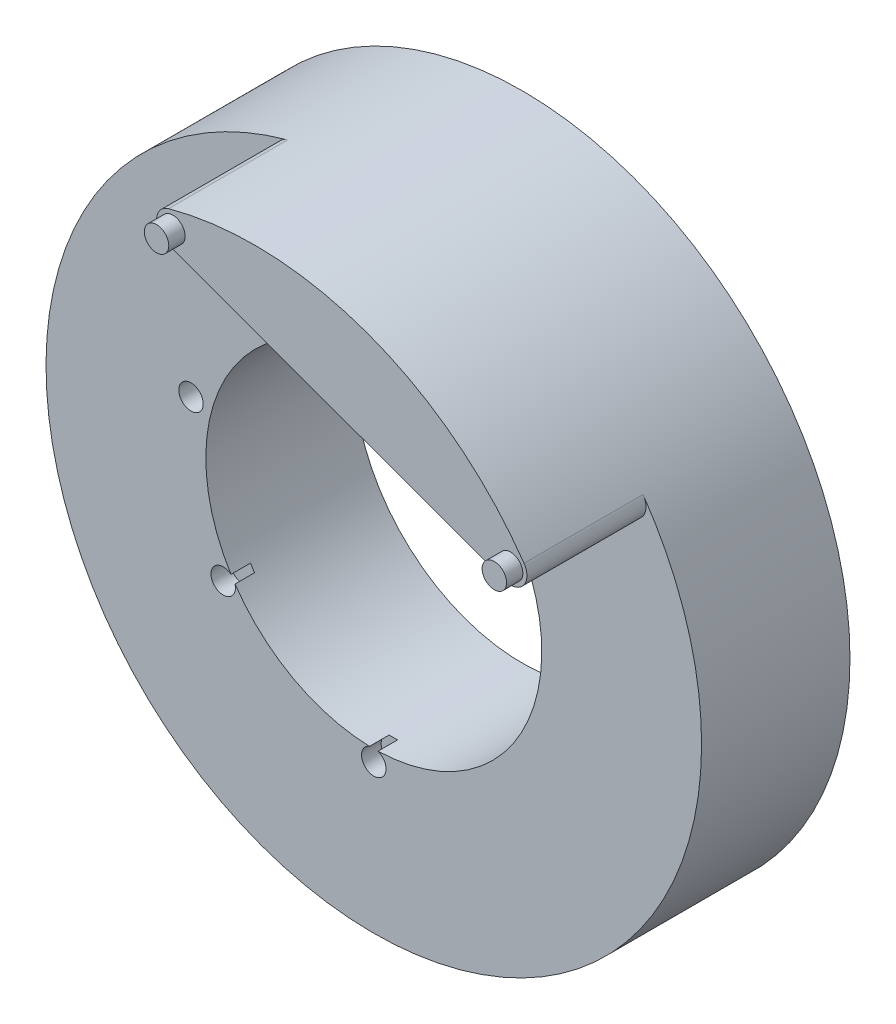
from build123d import *

# Parameters (mm, degrees)
ESQUISSE1_R             = 20.1
ESQUISSE1_R_2           = 10.299999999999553
BOSS_EXTRU_1_DEPTH      = 9.1
BOSS_EXTRU_2_DEPTH      = 7.3
CONG_1_R                = 1
ESQUISSE3_R             = 0.7500000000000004
ESQUISSE3_R_2           = 0.7500000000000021
BOSS_EXTRU_3_DEPTH      = 1
ESQUISSE4_R             = 0.7500000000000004
ESQUISSE4_R_2           = 0.75
ENL_V_MAT_EXTRU_1_DEPTH = 1.2


with BuildPart() as part:
    # Esquisse1 → Boss.-Extru.1 (new body)
    with BuildSketch(Plane.XY):
        with Locations((4.3684e-13, 11)):
            Circle(ESQUISSE1_R)
        with Locations((4.3684e-13, 11)):
            Circle(ESQUISSE1_R_2, mode=Mode.SUBTRACT)
    extrude(amount=BOSS_EXTRU_1_DEPTH)

    # Esquisse2 → Boss.-Extru.2 (add)
    with BuildSketch(Plane.XY.offset(9.100000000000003)):
        with BuildLine():
            Line((-7.988215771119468, 29.44446824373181), (17.97520395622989, 19.9945562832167))
            ThreePointArc((17.97520395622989, 19.9945562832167), (6.874604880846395, 29.88782167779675), (-7.988215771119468, 29.44446824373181))
        make_face()
    extrude(amount=BOSS_EXTRU_2_DEPTH)

    # Cong_1
    cong_1_edges = [part.edges().sort_by_distance(p)[0] for p in [
        (17.97520395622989, 19.994556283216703, 12.750000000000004),
        (-7.988215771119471, 29.44446824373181, 12.750000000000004),
    ]]
    fillet(cong_1_edges, radius=CONG_1_R)

    # Esquisse3 → Boss.-Extru.3 (add)
    with BuildSketch(Plane.XY.offset(16.400000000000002)):
        with Locations((-5.020307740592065, 29.428415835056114)):
            Circle(ESQUISSE3_R)
        with Locations((15.691336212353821, 21.88999393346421)):
            Circle(ESQUISSE3_R_2)
    extrude(amount=BOSS_EXTRU_3_DEPTH)

    # Esquisse4 → Enl_v. mat.-Extru.1 (cut)
    with BuildSketch(Plane.XY.offset(9.100000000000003)):
        with Locations((-11.207630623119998, 13.780728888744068)):
            Circle(ESQUISSE4_R)
        with Locations((-9.23309265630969, 4.999999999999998)):
            Circle(ESQUISSE4_R)
        Circle(ESQUISSE4_R_2)
    extrude(amount=-ENL_V_MAT_EXTRU_1_DEPTH, mode=Mode.SUBTRACT)


solid = part.part
